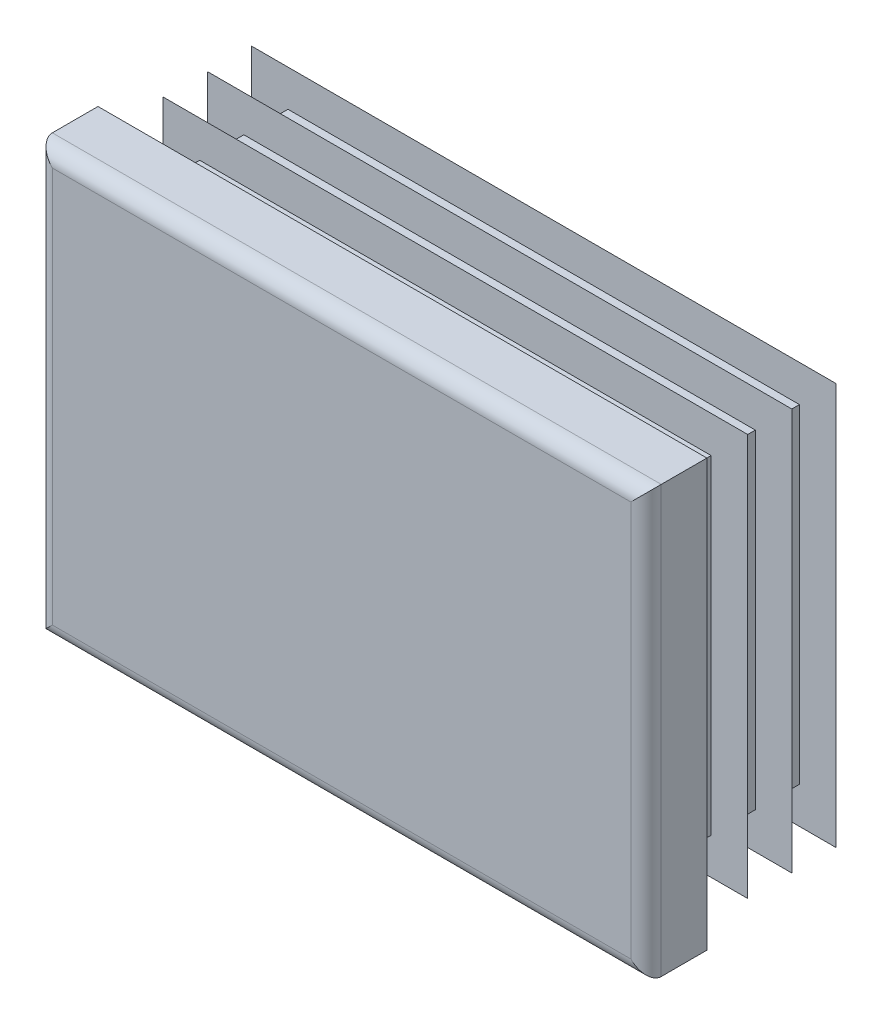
ISO-10303-21;
HEADER;
FILE_DESCRIPTION(('STEP AP214'),'2;1');
FILE_NAME('part.step','',(''),(''),'','','');
FILE_SCHEMA(('AUTOMOTIVE_DESIGN { 1 0 10303 214 1 1 1 1 }'));
ENDSEC;
DATA;
#1=APPLICATION_CONTEXT('core data for automotive mechanical design processes');
#2=APPLICATION_PROTOCOL_DEFINITION('international standard','automotive_design',2000,#1);
#3=PRODUCT_CONTEXT('',#1,'mechanical');
#4=PRODUCT('Part','Part','',(#3));
#5=PRODUCT_RELATED_PRODUCT_CATEGORY('part','',(#4));
#6=PRODUCT_DEFINITION_FORMATION('','',#4);
#7=PRODUCT_DEFINITION_CONTEXT('part definition',#1,'design');
#8=PRODUCT_DEFINITION('design','',#6,#7);
#9=PRODUCT_DEFINITION_SHAPE('','',#8);
#10=(LENGTH_UNIT() NAMED_UNIT(*) SI_UNIT(.MILLI.,.METRE.));
#11=(NAMED_UNIT(*) PLANE_ANGLE_UNIT() SI_UNIT($,.RADIAN.));
#12=(NAMED_UNIT(*) SI_UNIT($,.STERADIAN.) SOLID_ANGLE_UNIT());
#13=UNCERTAINTY_MEASURE_WITH_UNIT(LENGTH_MEASURE(1.E-05),#10,'distance_accuracy_value','');
#14=(GEOMETRIC_REPRESENTATION_CONTEXT(3) GLOBAL_UNCERTAINTY_ASSIGNED_CONTEXT((#13)) GLOBAL_UNIT_ASSIGNED_CONTEXT((#10,
#11,#12)) REPRESENTATION_CONTEXT('',''));
#15=CARTESIAN_POINT('',(0.,0.,0.));
#16=DIRECTION('',(0.,0.,1.));
#17=DIRECTION('',(1.,0.,0.));
#18=AXIS2_PLACEMENT_3D('',#15,#16,#17);
#19=CARTESIAN_POINT('',(23.75,-17.5,5.));
#20=DIRECTION('',(0.,0.,-1.));
#21=DIRECTION('',(0.,1.,0.));
#22=AXIS2_PLACEMENT_3D('',#19,#20,#21);
#23=PLANE('',#22);
#24=DIRECTION('',(0.,1.,0.));
#25=VECTOR('',#24,1.);
#26=CARTESIAN_POINT('',(-23.75,-17.5,5.));
#27=LINE('',#26,#25);
#28=CARTESIAN_POINT('',(-23.75,-16.25,5.));
#29=VERTEX_POINT('',#28);
#30=CARTESIAN_POINT('',(-23.75,16.25,5.));
#31=VERTEX_POINT('',#30);
#32=EDGE_CURVE('E310',#29,#31,#27,.T.);
#33=ORIENTED_EDGE('',*,*,#32,.F.);
#34=DIRECTION('',(-1.,0.,0.));
#35=VECTOR('',#34,1.);
#36=CARTESIAN_POINT('',(25.,-16.25,5.));
#37=LINE('',#36,#35);
#38=CARTESIAN_POINT('',(23.75,-16.25,5.));
#39=VERTEX_POINT('',#38);
#40=EDGE_CURVE('E482',#39,#29,#37,.T.);
#41=ORIENTED_EDGE('',*,*,#40,.F.);
#42=DIRECTION('',(0.,1.,0.));
#43=VECTOR('',#42,1.);
#44=CARTESIAN_POINT('',(23.75,-17.5,5.));
#45=LINE('',#44,#43);
#46=CARTESIAN_POINT('',(23.75,16.25,5.));
#47=VERTEX_POINT('',#46);
#48=EDGE_CURVE('E305',#39,#47,#45,.T.);
#49=ORIENTED_EDGE('',*,*,#48,.T.);
#50=DIRECTION('',(-1.,0.,0.));
#51=VECTOR('',#50,1.);
#52=CARTESIAN_POINT('',(25.,16.25,5.));
#53=LINE('',#52,#51);
#54=EDGE_CURVE('E630',#47,#31,#53,.T.);
#55=ORIENTED_EDGE('',*,*,#54,.T.);
#56=EDGE_LOOP('',(#33,#41,#49,#55));
#57=FACE_BOUND('',#56,.T.);
#58=ADVANCED_FACE('F14',(#57),#23,.F.);
#59=CARTESIAN_POINT('',(-23.75,-17.5,3.75));
#60=DIRECTION('',(0.,1.,0.));
#61=DIRECTION('',(-1.,0.,0.));
#62=AXIS2_PLACEMENT_3D('',#59,#60,#61);
#63=CYLINDRICAL_SURFACE('',#62,1.25);
#64=DIRECTION('',(0.,1.,0.));
#65=VECTOR('',#64,1.);
#66=CARTESIAN_POINT('',(-25.,-17.5,3.75));
#67=LINE('',#66,#65);
#68=CARTESIAN_POINT('',(-25.,-17.5,3.75));
#69=VERTEX_POINT('',#68);
#70=CARTESIAN_POINT('',(-25.,17.5,3.75));
#71=VERTEX_POINT('',#70);
#72=EDGE_CURVE('E402',#69,#71,#67,.T.);
#73=ORIENTED_EDGE('',*,*,#72,.F.);
#74=CARTESIAN_POINT('',(-23.75,-16.25,3.75));
#75=DIRECTION('',(-0.707106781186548,0.707106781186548,0.));
#76=DIRECTION('',(0.707106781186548,0.707106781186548,0.));
#77=AXIS2_PLACEMENT_3D('',#74,#75,#76);
#78=ELLIPSE('',#77,1.76776695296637,1.25);
#79=EDGE_CURVE('E59',#69,#29,#78,.T.);
#80=ORIENTED_EDGE('',*,*,#79,.T.);
#81=ORIENTED_EDGE('',*,*,#32,.T.);
#82=CARTESIAN_POINT('',(-23.75,16.25,3.75));
#83=DIRECTION('',(0.707106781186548,0.707106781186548,0.));
#84=DIRECTION('',(-0.707106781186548,0.707106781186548,0.));
#85=AXIS2_PLACEMENT_3D('',#82,#83,#84);
#86=ELLIPSE('',#85,1.76776695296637,1.25);
#87=EDGE_CURVE('E306',#31,#71,#86,.F.);
#88=ORIENTED_EDGE('',*,*,#87,.T.);
#89=EDGE_LOOP('',(#73,#80,#81,#88));
#90=FACE_BOUND('',#89,.T.);
#91=ADVANCED_FACE('F16',(#90),#63,.T.);
#92=CARTESIAN_POINT('',(-25.,-17.5,3.75));
#93=DIRECTION('',(1.,0.,0.));
#94=DIRECTION('',(0.,1.,0.));
#95=AXIS2_PLACEMENT_3D('',#92,#93,#94);
#96=PLANE('',#95);
#97=DIRECTION('',(0.,0.,-1.));
#98=VECTOR('',#97,1.);
#99=CARTESIAN_POINT('',(-25.,17.5,3.75));
#100=LINE('',#99,#98);
#101=CARTESIAN_POINT('',(-25.,17.5,0.));
#102=VERTEX_POINT('',#101);
#103=EDGE_CURVE('E615',#71,#102,#100,.T.);
#104=ORIENTED_EDGE('',*,*,#103,.T.);
#105=DIRECTION('',(0.,1.,0.));
#106=VECTOR('',#105,1.);
#107=CARTESIAN_POINT('',(-25.,-17.5,0.));
#108=LINE('',#107,#106);
#109=CARTESIAN_POINT('',(-25.,-17.5,0.));
#110=VERTEX_POINT('',#109);
#111=EDGE_CURVE('E400',#110,#102,#108,.T.);
#112=ORIENTED_EDGE('',*,*,#111,.F.);
#113=DIRECTION('',(0.,0.,-1.));
#114=VECTOR('',#113,1.);
#115=CARTESIAN_POINT('',(-25.,-17.5,3.75));
#116=LINE('',#115,#114);
#117=EDGE_CURVE('E616',#69,#110,#116,.T.);
#118=ORIENTED_EDGE('',*,*,#117,.F.);
#119=ORIENTED_EDGE('',*,*,#72,.T.);
#120=EDGE_LOOP('',(#104,#112,#118,#119));
#121=FACE_BOUND('',#120,.T.);
#122=ADVANCED_FACE('F697',(#121),#96,.F.);
#123=CARTESIAN_POINT('',(-21.,-17.5,0.));
#124=DIRECTION('',(1.,0.,0.));
#125=DIRECTION('',(0.,1.,0.));
#126=AXIS2_PLACEMENT_3D('',#123,#124,#125);
#127=PLANE('',#126);
#128=DIRECTION('',(0.,1.,0.));
#129=VECTOR('',#128,1.);
#130=CARTESIAN_POINT('',(-21.,-17.5,0.));
#131=LINE('',#130,#129);
#132=CARTESIAN_POINT('',(-21.,-13.5,0.));
#133=VERTEX_POINT('',#132);
#134=CARTESIAN_POINT('',(-21.,13.5,0.));
#135=VERTEX_POINT('',#134);
#136=EDGE_CURVE('E397',#133,#135,#131,.T.);
#137=ORIENTED_EDGE('',*,*,#136,.T.);
#138=DIRECTION('',(0.,0.,-1.));
#139=VECTOR('',#138,1.);
#140=CARTESIAN_POINT('',(-21.,13.5,0.));
#141=LINE('',#140,#139);
#142=CARTESIAN_POINT('',(-21.,13.5,-0.725));
#143=VERTEX_POINT('',#142);
#144=EDGE_CURVE('E495',#135,#143,#141,.T.);
#145=ORIENTED_EDGE('',*,*,#144,.T.);
#146=DIRECTION('',(0.,1.,0.));
#147=VECTOR('',#146,1.);
#148=CARTESIAN_POINT('',(-21.,-17.5,-0.725));
#149=LINE('',#148,#147);
#150=CARTESIAN_POINT('',(-21.,-13.5,-0.725));
#151=VERTEX_POINT('',#150);
#152=EDGE_CURVE('E394',#151,#143,#149,.T.);
#153=ORIENTED_EDGE('',*,*,#152,.F.);
#154=DIRECTION('',(0.,0.,1.));
#155=VECTOR('',#154,1.);
#156=CARTESIAN_POINT('',(-21.,-13.5,0.));
#157=LINE('',#156,#155);
#158=EDGE_CURVE('E489',#151,#133,#157,.T.);
#159=ORIENTED_EDGE('',*,*,#158,.T.);
#160=EDGE_LOOP('',(#137,#145,#153,#159));
#161=FACE_BOUND('',#160,.T.);
#162=ADVANCED_FACE('F787',(#161),#127,.F.);
#163=CARTESIAN_POINT('',(-24.,-17.5,-0.725));
#164=DIRECTION('',(0.342020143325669,0.,0.939692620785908));
#165=DIRECTION('',(-0.939692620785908,0.,0.342020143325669));
#166=AXIS2_PLACEMENT_3D('',#163,#164,#165);
#167=PLANE('',#166);
#168=DIRECTION('',(0.,1.,0.));
#169=VECTOR('',#168,1.);
#170=CARTESIAN_POINT('',(-24.,-17.5,-0.725));
#171=LINE('',#170,#169);
#172=CARTESIAN_POINT('',(-24.,-16.5,-0.725));
#173=VERTEX_POINT('',#172);
#174=CARTESIAN_POINT('',(-24.,16.5,-0.725));
#175=VERTEX_POINT('',#174);
#176=EDGE_CURVE('E392',#173,#175,#171,.T.);
#177=ORIENTED_EDGE('',*,*,#176,.T.);
#178=DIRECTION('',(0.844349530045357,-0.438895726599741,-0.307318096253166));
#179=VECTOR('',#178,1.);
#180=CARTESIAN_POINT('',(-11.4002323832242,9.9505983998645,-5.31094037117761));
#181=LINE('',#180,#179);
#182=CARTESIAN_POINT('',(-21.,14.9405899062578,-1.81691070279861));
#183=VERTEX_POINT('',#182);
#184=EDGE_CURVE('E519',#175,#183,#181,.T.);
#185=ORIENTED_EDGE('',*,*,#184,.T.);
#186=DIRECTION('',(0.,1.,0.));
#187=VECTOR('',#186,1.);
#188=CARTESIAN_POINT('',(-21.,-17.5,-1.81691070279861));
#189=LINE('',#188,#187);
#190=CARTESIAN_POINT('',(-21.,-14.9405899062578,-1.81691070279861));
#191=VERTEX_POINT('',#190);
#192=EDGE_CURVE('E389',#191,#183,#189,.T.);
#193=ORIENTED_EDGE('',*,*,#192,.F.);
#194=DIRECTION('',(-0.844349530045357,-0.43889572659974,0.307318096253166));
#195=VECTOR('',#194,1.);
#196=CARTESIAN_POINT('',(-24.3705814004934,-16.6926294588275,-0.590119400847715));
#197=LINE('',#196,#195);
#198=EDGE_CURVE('E507',#191,#173,#197,.T.);
#199=ORIENTED_EDGE('',*,*,#198,.T.);
#200=EDGE_LOOP('',(#177,#185,#193,#199));
#201=FACE_BOUND('',#200,.T.);
#202=ADVANCED_FACE('F783',(#201),#167,.F.);
#203=CARTESIAN_POINT('',(-21.,-17.5,-1.81691070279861));
#204=DIRECTION('',(1.,0.,0.));
#205=DIRECTION('',(0.,1.,0.));
#206=AXIS2_PLACEMENT_3D('',#203,#204,#205);
#207=PLANE('',#206);
#208=ORIENTED_EDGE('',*,*,#192,.T.);
#209=DIRECTION('',(0.,-0.819152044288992,-0.573576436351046));
#210=VECTOR('',#209,1.);
#211=CARTESIAN_POINT('',(-21.,-6.82737265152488,-17.0590021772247));
#212=LINE('',#211,#210);
#213=CARTESIAN_POINT('',(-21.,13.5,-2.82562261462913));
#214=VERTEX_POINT('',#213);
#215=EDGE_CURVE('E516',#183,#214,#212,.T.);
#216=ORIENTED_EDGE('',*,*,#215,.T.);
#217=DIRECTION('',(0.,0.,-1.));
#218=VECTOR('',#217,1.);
#219=CARTESIAN_POINT('',(-21.,13.5,-1.81691070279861));
#220=LINE('',#219,#218);
#221=CARTESIAN_POINT('',(-21.,13.5,-4.35));
#222=VERTEX_POINT('',#221);
#223=EDGE_CURVE('E525',#214,#222,#220,.T.);
#224=ORIENTED_EDGE('',*,*,#223,.T.);
#225=DIRECTION('',(0.,1.,0.));
#226=VECTOR('',#225,1.);
#227=CARTESIAN_POINT('',(-21.,-17.5,-4.35));
#228=LINE('',#227,#226);
#229=CARTESIAN_POINT('',(-21.,-13.5,-4.35));
#230=VERTEX_POINT('',#229);
#231=EDGE_CURVE('E386',#230,#222,#228,.T.);
#232=ORIENTED_EDGE('',*,*,#231,.F.);
#233=DIRECTION('',(0.,0.,1.));
#234=VECTOR('',#233,1.);
#235=CARTESIAN_POINT('',(-21.,-13.5,-1.81691070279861));
#236=LINE('',#235,#234);
#237=CARTESIAN_POINT('',(-21.,-13.5,-2.82562261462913));
#238=VERTEX_POINT('',#237);
#239=EDGE_CURVE('E522',#230,#238,#236,.T.);
#240=ORIENTED_EDGE('',*,*,#239,.T.);
#241=DIRECTION('',(0.,-0.819152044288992,0.573576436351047));
#242=VECTOR('',#241,1.);
#243=CARTESIAN_POINT('',(-21.,-16.6579798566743,-0.614381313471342));
#244=LINE('',#243,#242);
#245=EDGE_CURVE('E504',#238,#191,#244,.T.);
#246=ORIENTED_EDGE('',*,*,#245,.T.);
#247=EDGE_LOOP('',(#208,#216,#224,#232,#240,#246));
#248=FACE_BOUND('',#247,.T.);
#249=ADVANCED_FACE('F779',(#248),#207,.F.);
#250=CARTESIAN_POINT('',(-24.,-17.5,-4.35));
#251=DIRECTION('',(0.342020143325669,0.,0.939692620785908));
#252=DIRECTION('',(-0.939692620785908,0.,0.342020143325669));
#253=AXIS2_PLACEMENT_3D('',#250,#251,#252);
#254=PLANE('',#253);
#255=DIRECTION('',(0.,1.,0.));
#256=VECTOR('',#255,1.);
#257=CARTESIAN_POINT('',(-24.,-17.5,-4.35));
#258=LINE('',#257,#256);
#259=CARTESIAN_POINT('',(-24.,-16.5,-4.35));
#260=VERTEX_POINT('',#259);
#261=CARTESIAN_POINT('',(-24.,16.5,-4.35));
#262=VERTEX_POINT('',#261);
#263=EDGE_CURVE('E384',#260,#262,#258,.T.);
#264=ORIENTED_EDGE('',*,*,#263,.T.);
#265=DIRECTION('',(0.844349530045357,-0.438895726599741,-0.307318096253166));
#266=VECTOR('',#265,1.);
#267=CARTESIAN_POINT('',(-11.4002323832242,9.9505983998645,-8.93594037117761));
#268=LINE('',#267,#266);
#269=CARTESIAN_POINT('',(-21.,14.9405899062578,-5.44191070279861));
#270=VERTEX_POINT('',#269);
#271=EDGE_CURVE('E549',#262,#270,#268,.T.);
#272=ORIENTED_EDGE('',*,*,#271,.T.);
#273=DIRECTION('',(0.,1.,0.));
#274=VECTOR('',#273,1.);
#275=CARTESIAN_POINT('',(-21.,-17.5,-5.44191070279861));
#276=LINE('',#275,#274);
#277=CARTESIAN_POINT('',(-21.,-14.9405899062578,-5.44191070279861));
#278=VERTEX_POINT('',#277);
#279=EDGE_CURVE('E381',#278,#270,#276,.T.);
#280=ORIENTED_EDGE('',*,*,#279,.F.);
#281=DIRECTION('',(-0.844349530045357,-0.438895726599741,0.307318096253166));
#282=VECTOR('',#281,1.);
#283=CARTESIAN_POINT('',(-24.3705814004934,-16.6926294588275,-4.21511940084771));
#284=LINE('',#283,#282);
#285=EDGE_CURVE('E537',#278,#260,#284,.T.);
#286=ORIENTED_EDGE('',*,*,#285,.T.);
#287=EDGE_LOOP('',(#264,#272,#280,#286));
#288=FACE_BOUND('',#287,.T.);
#289=ADVANCED_FACE('F775',(#288),#254,.F.);
#290=CARTESIAN_POINT('',(-21.,-17.5,-5.44191070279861));
#291=DIRECTION('',(1.,0.,0.));
#292=DIRECTION('',(0.,1.,0.));
#293=AXIS2_PLACEMENT_3D('',#290,#291,#292);
#294=PLANE('',#293);
#295=ORIENTED_EDGE('',*,*,#279,.T.);
#296=DIRECTION('',(0.,-0.819152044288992,-0.573576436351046));
#297=VECTOR('',#296,1.);
#298=CARTESIAN_POINT('',(-21.,-6.82737265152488,-20.6840021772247));
#299=LINE('',#298,#297);
#300=CARTESIAN_POINT('',(-21.,13.5,-6.45062261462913));
#301=VERTEX_POINT('',#300);
#302=EDGE_CURVE('E546',#270,#301,#299,.T.);
#303=ORIENTED_EDGE('',*,*,#302,.T.);
#304=DIRECTION('',(0.,0.,-1.));
#305=VECTOR('',#304,1.);
#306=CARTESIAN_POINT('',(-21.,13.5,-5.44191070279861));
#307=LINE('',#306,#305);
#308=CARTESIAN_POINT('',(-21.,13.5,-7.975));
#309=VERTEX_POINT('',#308);
#310=EDGE_CURVE('E555',#301,#309,#307,.T.);
#311=ORIENTED_EDGE('',*,*,#310,.T.);
#312=DIRECTION('',(0.,1.,0.));
#313=VECTOR('',#312,1.);
#314=CARTESIAN_POINT('',(-21.,-17.5,-7.975));
#315=LINE('',#314,#313);
#316=CARTESIAN_POINT('',(-21.,-13.5,-7.975));
#317=VERTEX_POINT('',#316);
#318=EDGE_CURVE('E378',#317,#309,#315,.T.);
#319=ORIENTED_EDGE('',*,*,#318,.F.);
#320=DIRECTION('',(0.,0.,1.));
#321=VECTOR('',#320,1.);
#322=CARTESIAN_POINT('',(-21.,-13.5,-5.44191070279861));
#323=LINE('',#322,#321);
#324=CARTESIAN_POINT('',(-21.,-13.5,-6.45062261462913));
#325=VERTEX_POINT('',#324);
#326=EDGE_CURVE('E552',#317,#325,#323,.T.);
#327=ORIENTED_EDGE('',*,*,#326,.T.);
#328=DIRECTION('',(0.,-0.819152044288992,0.573576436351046));
#329=VECTOR('',#328,1.);
#330=CARTESIAN_POINT('',(-21.,-16.6579798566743,-4.23938131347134));
#331=LINE('',#330,#329);
#332=EDGE_CURVE('E534',#325,#278,#331,.T.);
#333=ORIENTED_EDGE('',*,*,#332,.T.);
#334=EDGE_LOOP('',(#295,#303,#311,#319,#327,#333));
#335=FACE_BOUND('',#334,.T.);
#336=ADVANCED_FACE('F771',(#335),#294,.F.);
#337=CARTESIAN_POINT('',(-24.,-17.5,-7.975));
#338=DIRECTION('',(0.342020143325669,0.,0.939692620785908));
#339=DIRECTION('',(-0.939692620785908,0.,0.342020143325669));
#340=AXIS2_PLACEMENT_3D('',#337,#338,#339);
#341=PLANE('',#340);
#342=DIRECTION('',(0.,1.,0.));
#343=VECTOR('',#342,1.);
#344=CARTESIAN_POINT('',(-24.,-17.5,-7.975));
#345=LINE('',#344,#343);
#346=CARTESIAN_POINT('',(-24.,-16.5,-7.975));
#347=VERTEX_POINT('',#346);
#348=CARTESIAN_POINT('',(-24.,16.5,-7.975));
#349=VERTEX_POINT('',#348);
#350=EDGE_CURVE('E376',#347,#349,#345,.T.);
#351=ORIENTED_EDGE('',*,*,#350,.T.);
#352=DIRECTION('',(0.844349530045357,-0.438895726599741,-0.307318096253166));
#353=VECTOR('',#352,1.);
#354=CARTESIAN_POINT('',(-11.4002323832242,9.95059839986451,-12.5609403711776));
#355=LINE('',#354,#353);
#356=CARTESIAN_POINT('',(-21.,14.9405899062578,-9.06691070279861));
#357=VERTEX_POINT('',#356);
#358=EDGE_CURVE('E579',#349,#357,#355,.T.);
#359=ORIENTED_EDGE('',*,*,#358,.T.);
#360=DIRECTION('',(0.,1.,0.));
#361=VECTOR('',#360,1.);
#362=CARTESIAN_POINT('',(-21.,-17.5,-9.06691070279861));
#363=LINE('',#362,#361);
#364=CARTESIAN_POINT('',(-21.,-14.9405899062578,-9.06691070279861));
#365=VERTEX_POINT('',#364);
#366=EDGE_CURVE('E373',#365,#357,#363,.T.);
#367=ORIENTED_EDGE('',*,*,#366,.F.);
#368=DIRECTION('',(-0.844349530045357,-0.438895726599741,0.307318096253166));
#369=VECTOR('',#368,1.);
#370=CARTESIAN_POINT('',(-24.3705814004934,-16.6926294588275,-7.84011940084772));
#371=LINE('',#370,#369);
#372=EDGE_CURVE('E567',#365,#347,#371,.T.);
#373=ORIENTED_EDGE('',*,*,#372,.T.);
#374=EDGE_LOOP('',(#351,#359,#367,#373));
#375=FACE_BOUND('',#374,.T.);
#376=ADVANCED_FACE('F767',(#375),#341,.F.);
#377=CARTESIAN_POINT('',(-21.,-17.5,-9.06691070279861));
#378=DIRECTION('',(1.,0.,0.));
#379=DIRECTION('',(0.,1.,0.));
#380=AXIS2_PLACEMENT_3D('',#377,#378,#379);
#381=PLANE('',#380);
#382=ORIENTED_EDGE('',*,*,#366,.T.);
#383=DIRECTION('',(0.,-0.819152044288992,-0.573576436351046));
#384=VECTOR('',#383,1.);
#385=CARTESIAN_POINT('',(-21.,-6.82737265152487,-24.3090021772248));
#386=LINE('',#385,#384);
#387=CARTESIAN_POINT('',(-21.,13.5,-10.0756226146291));
#388=VERTEX_POINT('',#387);
#389=EDGE_CURVE('E576',#357,#388,#386,.T.);
#390=ORIENTED_EDGE('',*,*,#389,.T.);
#391=DIRECTION('',(0.,0.,-1.));
#392=VECTOR('',#391,1.);
#393=CARTESIAN_POINT('',(-21.,13.5,-9.06691070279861));
#394=LINE('',#393,#392);
#395=CARTESIAN_POINT('',(-21.,13.5,-11.6));
#396=VERTEX_POINT('',#395);
#397=EDGE_CURVE('E585',#388,#396,#394,.T.);
#398=ORIENTED_EDGE('',*,*,#397,.T.);
#399=DIRECTION('',(0.,1.,0.));
#400=VECTOR('',#399,1.);
#401=CARTESIAN_POINT('',(-21.,-17.5,-11.6));
#402=LINE('',#401,#400);
#403=CARTESIAN_POINT('',(-21.,-13.5,-11.6));
#404=VERTEX_POINT('',#403);
#405=EDGE_CURVE('E370',#404,#396,#402,.T.);
#406=ORIENTED_EDGE('',*,*,#405,.F.);
#407=DIRECTION('',(0.,0.,1.));
#408=VECTOR('',#407,1.);
#409=CARTESIAN_POINT('',(-21.,-13.5,-9.06691070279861));
#410=LINE('',#409,#408);
#411=CARTESIAN_POINT('',(-21.,-13.5,-10.0756226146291));
#412=VERTEX_POINT('',#411);
#413=EDGE_CURVE('E582',#404,#412,#410,.T.);
#414=ORIENTED_EDGE('',*,*,#413,.T.);
#415=DIRECTION('',(0.,-0.819152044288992,0.573576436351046));
#416=VECTOR('',#415,1.);
#417=CARTESIAN_POINT('',(-21.,-16.6579798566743,-7.86438131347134));
#418=LINE('',#417,#416);
#419=EDGE_CURVE('E564',#412,#365,#418,.T.);
#420=ORIENTED_EDGE('',*,*,#419,.T.);
#421=EDGE_LOOP('',(#382,#390,#398,#406,#414,#420));
#422=FACE_BOUND('',#421,.T.);
#423=ADVANCED_FACE('F764',(#422),#381,.F.);
#424=CARTESIAN_POINT('',(-24.,-17.5,-11.6));
#425=DIRECTION('',(0.342020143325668,0.,0.939692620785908));
#426=DIRECTION('',(-0.939692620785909,0.,0.342020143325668));
#427=AXIS2_PLACEMENT_3D('',#424,#425,#426);
#428=PLANE('',#427);
#429=DIRECTION('',(0.,1.,0.));
#430=VECTOR('',#429,1.);
#431=CARTESIAN_POINT('',(-24.,-17.5,-11.6));
#432=LINE('',#431,#430);
#433=CARTESIAN_POINT('',(-24.,-16.5,-11.6));
#434=VERTEX_POINT('',#433);
#435=CARTESIAN_POINT('',(-24.,16.5,-11.6));
#436=VERTEX_POINT('',#435);
#437=EDGE_CURVE('E368',#434,#436,#432,.T.);
#438=ORIENTED_EDGE('',*,*,#437,.T.);
#439=DIRECTION('',(0.844349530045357,-0.43889572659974,-0.307318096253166));
#440=VECTOR('',#439,1.);
#441=CARTESIAN_POINT('',(-11.4002323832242,9.95059839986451,-16.1859403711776));
#442=LINE('',#441,#440);
#443=CARTESIAN_POINT('',(-21.,14.9405899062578,-12.6919107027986));
#444=VERTEX_POINT('',#443);
#445=EDGE_CURVE('E607',#436,#444,#442,.T.);
#446=ORIENTED_EDGE('',*,*,#445,.T.);
#447=DIRECTION('',(0.,1.,0.));
#448=VECTOR('',#447,1.);
#449=CARTESIAN_POINT('',(-21.,-17.5,-12.6919107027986));
#450=LINE('',#449,#448);
#451=CARTESIAN_POINT('',(-21.,-14.9405899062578,-12.6919107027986));
#452=VERTEX_POINT('',#451);
#453=EDGE_CURVE('E365',#452,#444,#450,.T.);
#454=ORIENTED_EDGE('',*,*,#453,.F.);
#455=DIRECTION('',(-0.844349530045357,-0.438895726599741,0.307318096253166));
#456=VECTOR('',#455,1.);
#457=CARTESIAN_POINT('',(-24.3705814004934,-16.6926294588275,-11.4651194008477));
#458=LINE('',#457,#456);
#459=EDGE_CURVE('E595',#452,#434,#458,.T.);
#460=ORIENTED_EDGE('',*,*,#459,.T.);
#461=EDGE_LOOP('',(#438,#446,#454,#460));
#462=FACE_BOUND('',#461,.T.);
#463=ADVANCED_FACE('F675',(#462),#428,.F.);
#464=CARTESIAN_POINT('',(-21.,-17.5,-12.6919107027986));
#465=DIRECTION('',(1.,0.,0.));
#466=DIRECTION('',(0.,1.,0.));
#467=AXIS2_PLACEMENT_3D('',#464,#465,#466);
#468=PLANE('',#467);
#469=ORIENTED_EDGE('',*,*,#453,.T.);
#470=DIRECTION('',(0.,-0.819152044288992,-0.573576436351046));
#471=VECTOR('',#470,1.);
#472=CARTESIAN_POINT('',(-21.,-6.82737265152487,-27.9340021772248));
#473=LINE('',#472,#471);
#474=CARTESIAN_POINT('',(-21.,13.5,-13.7006226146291));
#475=VERTEX_POINT('',#474);
#476=EDGE_CURVE('E604',#444,#475,#473,.T.);
#477=ORIENTED_EDGE('',*,*,#476,.T.);
#478=DIRECTION('',(0.,0.,-1.));
#479=VECTOR('',#478,1.);
#480=CARTESIAN_POINT('',(-21.,13.5,-12.6919107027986));
#481=LINE('',#480,#479);
#482=CARTESIAN_POINT('',(-21.,13.5,-14.5));
#483=VERTEX_POINT('',#482);
#484=EDGE_CURVE('E613',#475,#483,#481,.T.);
#485=ORIENTED_EDGE('',*,*,#484,.T.);
#486=DIRECTION('',(0.,1.,0.));
#487=VECTOR('',#486,1.);
#488=CARTESIAN_POINT('',(-21.,-17.5,-14.5));
#489=LINE('',#488,#487);
#490=CARTESIAN_POINT('',(-21.,-13.5,-14.5));
#491=VERTEX_POINT('',#490);
#492=EDGE_CURVE('E362',#491,#483,#489,.T.);
#493=ORIENTED_EDGE('',*,*,#492,.F.);
#494=DIRECTION('',(0.,0.,1.));
#495=VECTOR('',#494,1.);
#496=CARTESIAN_POINT('',(-21.,-13.5,-12.6919107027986));
#497=LINE('',#496,#495);
#498=CARTESIAN_POINT('',(-21.,-13.5,-13.7006226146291));
#499=VERTEX_POINT('',#498);
#500=EDGE_CURVE('E610',#491,#499,#497,.T.);
#501=ORIENTED_EDGE('',*,*,#500,.T.);
#502=DIRECTION('',(0.,-0.819152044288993,0.573576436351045));
#503=VECTOR('',#502,1.);
#504=CARTESIAN_POINT('',(-21.,-16.6579798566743,-11.4893813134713));
#505=LINE('',#504,#503);
#506=EDGE_CURVE('E592',#499,#452,#505,.T.);
#507=ORIENTED_EDGE('',*,*,#506,.T.);
#508=EDGE_LOOP('',(#469,#477,#485,#493,#501,#507));
#509=FACE_BOUND('',#508,.T.);
#510=ADVANCED_FACE('F677',(#509),#468,.F.);
#511=CARTESIAN_POINT('',(-21.,-17.5,-14.5));
#512=DIRECTION('',(0.,0.,1.));
#513=DIRECTION('',(0.,-1.,0.));
#514=AXIS2_PLACEMENT_3D('',#511,#512,#513);
#515=PLANE('',#514);
#516=ORIENTED_EDGE('',*,*,#492,.T.);
#517=DIRECTION('',(-1.,0.,0.));
#518=VECTOR('',#517,1.);
#519=CARTESIAN_POINT('',(25.,13.5,-14.5));
#520=LINE('',#519,#518);
#521=CARTESIAN_POINT('',(21.,13.5,-14.5));
#522=VERTEX_POINT('',#521);
#523=EDGE_CURVE('E438',#522,#483,#520,.T.);
#524=ORIENTED_EDGE('',*,*,#523,.F.);
#525=DIRECTION('',(0.,1.,0.));
#526=VECTOR('',#525,1.);
#527=CARTESIAN_POINT('',(21.,-17.5,-14.5));
#528=LINE('',#527,#526);
#529=CARTESIAN_POINT('',(21.,-13.5,-14.5));
#530=VERTEX_POINT('',#529);
#531=EDGE_CURVE('E359',#530,#522,#528,.T.);
#532=ORIENTED_EDGE('',*,*,#531,.F.);
#533=DIRECTION('',(-1.,0.,0.));
#534=VECTOR('',#533,1.);
#535=CARTESIAN_POINT('',(25.,-13.5,-14.5));
#536=LINE('',#535,#534);
#537=EDGE_CURVE('E436',#530,#491,#536,.T.);
#538=ORIENTED_EDGE('',*,*,#537,.T.);
#539=EDGE_LOOP('',(#516,#524,#532,#538));
#540=FACE_BOUND('',#539,.T.);
#541=ADVANCED_FACE('F435',(#540),#515,.F.);
#542=CARTESIAN_POINT('',(21.,-17.5,-14.5));
#543=DIRECTION('',(-1.,0.,0.));
#544=DIRECTION('',(0.,-1.,0.));
#545=AXIS2_PLACEMENT_3D('',#542,#543,#544);
#546=PLANE('',#545);
#547=DIRECTION('',(0.,0.,1.));
#548=VECTOR('',#547,1.);
#549=CARTESIAN_POINT('',(21.,13.5,-14.5));
#550=LINE('',#549,#548);
#551=CARTESIAN_POINT('',(21.,13.5,-13.7006226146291));
#552=VERTEX_POINT('',#551);
#553=EDGE_CURVE('E9',#522,#552,#550,.T.);
#554=ORIENTED_EDGE('',*,*,#553,.T.);
#555=DIRECTION('',(0.,0.819152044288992,0.573576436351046));
#556=VECTOR('',#555,1.);
#557=CARTESIAN_POINT('',(21.,-7.67689673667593,-28.5288453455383));
#558=LINE('',#557,#556);
#559=CARTESIAN_POINT('',(21.,14.9405899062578,-12.6919107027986));
#560=VERTEX_POINT('',#559);
#561=EDGE_CURVE('E601',#552,#560,#558,.T.);
#562=ORIENTED_EDGE('',*,*,#561,.T.);
#563=DIRECTION('',(0.,1.,0.));
#564=VECTOR('',#563,1.);
#565=CARTESIAN_POINT('',(21.,-17.5,-12.6919107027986));
#566=LINE('',#565,#564);
#567=CARTESIAN_POINT('',(21.,-14.9405899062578,-12.6919107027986));
#568=VERTEX_POINT('',#567);
#569=EDGE_CURVE('E356',#568,#560,#566,.T.);
#570=ORIENTED_EDGE('',*,*,#569,.F.);
#571=DIRECTION('',(0.,0.819152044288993,-0.573576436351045));
#572=VECTOR('',#571,1.);
#573=CARTESIAN_POINT('',(21.,-15.8084557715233,-12.0842244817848));
#574=LINE('',#573,#572);
#575=CARTESIAN_POINT('',(21.,-13.5,-13.7006226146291));
#576=VERTEX_POINT('',#575);
#577=EDGE_CURVE('E428',#568,#576,#574,.T.);
#578=ORIENTED_EDGE('',*,*,#577,.T.);
#579=DIRECTION('',(0.,0.,-1.));
#580=VECTOR('',#579,1.);
#581=CARTESIAN_POINT('',(21.,-13.5,-14.5));
#582=LINE('',#581,#580);
#583=EDGE_CURVE('E23',#576,#530,#582,.T.);
#584=ORIENTED_EDGE('',*,*,#583,.T.);
#585=ORIENTED_EDGE('',*,*,#531,.T.);
#586=EDGE_LOOP('',(#554,#562,#570,#578,#584,#585));
#587=FACE_BOUND('',#586,.T.);
#588=ADVANCED_FACE('F426',(#587),#546,.F.);
#589=CARTESIAN_POINT('',(21.,-17.5,-12.6919107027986));
#590=DIRECTION('',(-0.342020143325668,0.,0.939692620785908));
#591=DIRECTION('',(-0.939692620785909,0.,-0.342020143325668));
#592=AXIS2_PLACEMENT_3D('',#589,#590,#591);
#593=PLANE('',#592);
#594=ORIENTED_EDGE('',*,*,#569,.T.);
#595=DIRECTION('',(0.844349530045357,0.43889572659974,0.307318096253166));
#596=VECTOR('',#595,1.);
#597=CARTESIAN_POINT('',(8.97812075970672,8.69157662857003,-17.0675169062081));
#598=LINE('',#597,#596);
#599=CARTESIAN_POINT('',(24.,16.5,-11.6));
#600=VERTEX_POINT('',#599);
#601=EDGE_CURVE('E598',#560,#600,#598,.T.);
#602=ORIENTED_EDGE('',*,*,#601,.T.);
#603=DIRECTION('',(0.,1.,0.));
#604=VECTOR('',#603,1.);
#605=CARTESIAN_POINT('',(24.,-17.5,-11.6));
#606=LINE('',#605,#604);
#607=CARTESIAN_POINT('',(24.,-16.5,-11.6));
#608=VERTEX_POINT('',#607);
#609=EDGE_CURVE('E353',#608,#600,#606,.T.);
#610=ORIENTED_EDGE('',*,*,#609,.F.);
#611=DIRECTION('',(-0.844349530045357,0.438895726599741,-0.307318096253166));
#612=VECTOR('',#611,1.);
#613=CARTESIAN_POINT('',(21.948469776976,-15.433607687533,-12.3466959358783));
#614=LINE('',#613,#612);
#615=EDGE_CURVE('E588',#608,#568,#614,.T.);
#616=ORIENTED_EDGE('',*,*,#615,.T.);
#617=EDGE_LOOP('',(#594,#602,#610,#616));
#618=FACE_BOUND('',#617,.T.);
#619=ADVANCED_FACE('F752',(#618),#593,.F.);
#620=CARTESIAN_POINT('',(24.,-17.5,-11.6));
#621=DIRECTION('',(0.,0.,-1.));
#622=DIRECTION('',(0.,1.,0.));
#623=AXIS2_PLACEMENT_3D('',#620,#621,#622);
#624=PLANE('',#623);
#625=ORIENTED_EDGE('',*,*,#609,.T.);
#626=DIRECTION('',(-1.,0.,0.));
#627=VECTOR('',#626,1.);
#628=CARTESIAN_POINT('',(25.,16.5,-11.6));
#629=LINE('',#628,#627);
#630=EDGE_CURVE('E444',#600,#436,#629,.T.);
#631=ORIENTED_EDGE('',*,*,#630,.T.);
#632=ORIENTED_EDGE('',*,*,#437,.F.);
#633=DIRECTION('',(-1.,0.,0.));
#634=VECTOR('',#633,1.);
#635=CARTESIAN_POINT('',(25.,-16.5,-11.6));
#636=LINE('',#635,#634);
#637=EDGE_CURVE('E451',#608,#434,#636,.T.);
#638=ORIENTED_EDGE('',*,*,#637,.F.);
#639=EDGE_LOOP('',(#625,#631,#632,#638));
#640=FACE_BOUND('',#639,.T.);
#641=ORIENTED_EDGE('',*,*,#405,.T.);
#642=DIRECTION('',(-1.,0.,0.));
#643=VECTOR('',#642,1.);
#644=CARTESIAN_POINT('',(25.,13.5,-11.6));
#645=LINE('',#644,#643);
#646=CARTESIAN_POINT('',(21.,13.5,-11.6));
#647=VERTEX_POINT('',#646);
#648=EDGE_CURVE('E663',#647,#396,#645,.T.);
#649=ORIENTED_EDGE('',*,*,#648,.F.);
#650=DIRECTION('',(0.,1.,0.));
#651=VECTOR('',#650,1.);
#652=CARTESIAN_POINT('',(21.,-17.5,-11.6));
#653=LINE('',#652,#651);
#654=CARTESIAN_POINT('',(21.,-13.5,-11.6));
#655=VERTEX_POINT('',#654);
#656=EDGE_CURVE('E350',#655,#647,#653,.T.);
#657=ORIENTED_EDGE('',*,*,#656,.F.);
#658=DIRECTION('',(-1.,0.,0.));
#659=VECTOR('',#658,1.);
#660=CARTESIAN_POINT('',(25.,-13.5,-11.6));
#661=LINE('',#660,#659);
#662=EDGE_CURVE('E453',#655,#404,#661,.T.);
#663=ORIENTED_EDGE('',*,*,#662,.T.);
#664=EDGE_LOOP('',(#641,#649,#657,#663));
#665=FACE_BOUND('',#664,.T.);
#666=ADVANCED_FACE('F667',(#640,#665),#624,.F.);
#667=CARTESIAN_POINT('',(21.,-17.5,-11.6));
#668=DIRECTION('',(-1.,0.,0.));
#669=DIRECTION('',(0.,-1.,0.));
#670=AXIS2_PLACEMENT_3D('',#667,#668,#669);
#671=PLANE('',#670);
#672=DIRECTION('',(0.,0.,1.));
#673=VECTOR('',#672,1.);
#674=CARTESIAN_POINT('',(21.,13.5,-11.6));
#675=LINE('',#674,#673);
#676=CARTESIAN_POINT('',(21.,13.5,-10.0756226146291));
#677=VERTEX_POINT('',#676);
#678=EDGE_CURVE('E420',#647,#677,#675,.T.);
#679=ORIENTED_EDGE('',*,*,#678,.T.);
#680=DIRECTION('',(0.,0.819152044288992,0.573576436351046));
#681=VECTOR('',#680,1.);
#682=CARTESIAN_POINT('',(21.,-8.01753531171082,-25.1423630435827));
#683=LINE('',#682,#681);
#684=CARTESIAN_POINT('',(21.,14.9405899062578,-9.06691070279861));
#685=VERTEX_POINT('',#684);
#686=EDGE_CURVE('E573',#677,#685,#683,.T.);
#687=ORIENTED_EDGE('',*,*,#686,.T.);
#688=DIRECTION('',(0.,1.,0.));
#689=VECTOR('',#688,1.);
#690=CARTESIAN_POINT('',(21.,-17.5,-9.06691070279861));
#691=LINE('',#690,#689);
#692=CARTESIAN_POINT('',(21.,-14.9405899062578,-9.06691070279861));
#693=VERTEX_POINT('',#692);
#694=EDGE_CURVE('E347',#693,#685,#691,.T.);
#695=ORIENTED_EDGE('',*,*,#694,.F.);
#696=DIRECTION('',(0.,0.819152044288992,-0.573576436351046));
#697=VECTOR('',#696,1.);
#698=CARTESIAN_POINT('',(21.,-15.4678171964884,-8.69774217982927));
#699=LINE('',#698,#697);
#700=CARTESIAN_POINT('',(21.,-13.5,-10.0756226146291));
#701=VERTEX_POINT('',#700);
#702=EDGE_CURVE('E561',#693,#701,#699,.T.);
#703=ORIENTED_EDGE('',*,*,#702,.T.);
#704=DIRECTION('',(0.,0.,-1.));
#705=VECTOR('',#704,1.);
#706=CARTESIAN_POINT('',(21.,-13.5,-11.6));
#707=LINE('',#706,#705);
#708=EDGE_CURVE('E417',#701,#655,#707,.T.);
#709=ORIENTED_EDGE('',*,*,#708,.T.);
#710=ORIENTED_EDGE('',*,*,#656,.T.);
#711=EDGE_LOOP('',(#679,#687,#695,#703,#709,#710));
#712=FACE_BOUND('',#711,.T.);
#713=ADVANCED_FACE('F745',(#712),#671,.F.);
#714=CARTESIAN_POINT('',(21.,-17.5,-9.06691070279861));
#715=DIRECTION('',(-0.342020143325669,0.,0.939692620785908));
#716=DIRECTION('',(-0.939692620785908,0.,-0.342020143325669));
#717=AXIS2_PLACEMENT_3D('',#714,#715,#716);
#718=PLANE('',#717);
#719=ORIENTED_EDGE('',*,*,#694,.T.);
#720=DIRECTION('',(0.844349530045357,0.438895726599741,0.307318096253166));
#721=VECTOR('',#720,1.);
#722=CARTESIAN_POINT('',(8.97812075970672,8.69157662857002,-13.4425169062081));
#723=LINE('',#722,#721);
#724=CARTESIAN_POINT('',(24.,16.5,-7.975));
#725=VERTEX_POINT('',#724);
#726=EDGE_CURVE('E570',#685,#725,#723,.T.);
#727=ORIENTED_EDGE('',*,*,#726,.T.);
#728=DIRECTION('',(0.,1.,0.));
#729=VECTOR('',#728,1.);
#730=CARTESIAN_POINT('',(24.,-17.5,-7.975));
#731=LINE('',#730,#729);
#732=CARTESIAN_POINT('',(24.,-16.5,-7.975));
#733=VERTEX_POINT('',#732);
#734=EDGE_CURVE('E344',#733,#725,#731,.T.);
#735=ORIENTED_EDGE('',*,*,#734,.F.);
#736=DIRECTION('',(-0.844349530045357,0.438895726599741,-0.307318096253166));
#737=VECTOR('',#736,1.);
#738=CARTESIAN_POINT('',(21.948469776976,-15.433607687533,-8.72169593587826));
#739=LINE('',#738,#737);
#740=EDGE_CURVE('E558',#733,#693,#739,.T.);
#741=ORIENTED_EDGE('',*,*,#740,.T.);
#742=EDGE_LOOP('',(#719,#727,#735,#741));
#743=FACE_BOUND('',#742,.T.);
#744=ADVANCED_FACE('F741',(#743),#718,.F.);
#745=CARTESIAN_POINT('',(24.,-17.5,-7.975));
#746=DIRECTION('',(0.,0.,-1.));
#747=DIRECTION('',(0.,1.,0.));
#748=AXIS2_PLACEMENT_3D('',#745,#746,#747);
#749=PLANE('',#748);
#750=ORIENTED_EDGE('',*,*,#734,.T.);
#751=DIRECTION('',(-1.,0.,0.));
#752=VECTOR('',#751,1.);
#753=CARTESIAN_POINT('',(25.,16.5,-7.975));
#754=LINE('',#753,#752);
#755=EDGE_CURVE('E657',#725,#349,#754,.T.);
#756=ORIENTED_EDGE('',*,*,#755,.T.);
#757=ORIENTED_EDGE('',*,*,#350,.F.);
#758=DIRECTION('',(-1.,0.,0.));
#759=VECTOR('',#758,1.);
#760=CARTESIAN_POINT('',(25.,-16.5,-7.975));
#761=LINE('',#760,#759);
#762=EDGE_CURVE('E459',#733,#347,#761,.T.);
#763=ORIENTED_EDGE('',*,*,#762,.F.);
#764=EDGE_LOOP('',(#750,#756,#757,#763));
#765=FACE_BOUND('',#764,.T.);
#766=ORIENTED_EDGE('',*,*,#318,.T.);
#767=DIRECTION('',(-1.,0.,0.));
#768=VECTOR('',#767,1.);
#769=CARTESIAN_POINT('',(25.,13.5,-7.975));
#770=LINE('',#769,#768);
#771=CARTESIAN_POINT('',(21.,13.5,-7.975));
#772=VERTEX_POINT('',#771);
#773=EDGE_CURVE('E655',#772,#309,#770,.T.);
#774=ORIENTED_EDGE('',*,*,#773,.F.);
#775=DIRECTION('',(0.,1.,0.));
#776=VECTOR('',#775,1.);
#777=CARTESIAN_POINT('',(21.,-17.5,-7.975));
#778=LINE('',#777,#776);
#779=CARTESIAN_POINT('',(21.,-13.5,-7.975));
#780=VERTEX_POINT('',#779);
#781=EDGE_CURVE('E341',#780,#772,#778,.T.);
#782=ORIENTED_EDGE('',*,*,#781,.F.);
#783=DIRECTION('',(-1.,0.,0.));
#784=VECTOR('',#783,1.);
#785=CARTESIAN_POINT('',(25.,-13.5,-7.975));
#786=LINE('',#785,#784);
#787=EDGE_CURVE('E461',#780,#317,#786,.T.);
#788=ORIENTED_EDGE('',*,*,#787,.T.);
#789=EDGE_LOOP('',(#766,#774,#782,#788));
#790=FACE_BOUND('',#789,.T.);
#791=ADVANCED_FACE('F737',(#765,#790),#749,.F.);
#792=CARTESIAN_POINT('',(21.,-17.5,-7.975));
#793=DIRECTION('',(-1.,0.,0.));
#794=DIRECTION('',(0.,-1.,0.));
#795=AXIS2_PLACEMENT_3D('',#792,#793,#794);
#796=PLANE('',#795);
#797=DIRECTION('',(0.,0.,1.));
#798=VECTOR('',#797,1.);
#799=CARTESIAN_POINT('',(21.,13.5,-7.975));
#800=LINE('',#799,#798);
#801=CARTESIAN_POINT('',(21.,13.5,-6.45062261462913));
#802=VERTEX_POINT('',#801);
#803=EDGE_CURVE('E414',#772,#802,#800,.T.);
#804=ORIENTED_EDGE('',*,*,#803,.T.);
#805=DIRECTION('',(0.,0.819152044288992,0.573576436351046));
#806=VECTOR('',#805,1.);
#807=CARTESIAN_POINT('',(21.,-8.01753531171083,-21.5173630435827));
#808=LINE('',#807,#806);
#809=CARTESIAN_POINT('',(21.,14.9405899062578,-5.44191070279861));
#810=VERTEX_POINT('',#809);
#811=EDGE_CURVE('E543',#802,#810,#808,.T.);
#812=ORIENTED_EDGE('',*,*,#811,.T.);
#813=DIRECTION('',(0.,1.,0.));
#814=VECTOR('',#813,1.);
#815=CARTESIAN_POINT('',(21.,-17.5,-5.44191070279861));
#816=LINE('',#815,#814);
#817=CARTESIAN_POINT('',(21.,-14.9405899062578,-5.44191070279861));
#818=VERTEX_POINT('',#817);
#819=EDGE_CURVE('E338',#818,#810,#816,.T.);
#820=ORIENTED_EDGE('',*,*,#819,.F.);
#821=DIRECTION('',(0.,0.819152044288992,-0.573576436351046));
#822=VECTOR('',#821,1.);
#823=CARTESIAN_POINT('',(21.,-15.4678171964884,-5.07274217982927));
#824=LINE('',#823,#822);
#825=CARTESIAN_POINT('',(21.,-13.5,-6.45062261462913));
#826=VERTEX_POINT('',#825);
#827=EDGE_CURVE('E531',#818,#826,#824,.T.);
#828=ORIENTED_EDGE('',*,*,#827,.T.);
#829=DIRECTION('',(0.,0.,-1.));
#830=VECTOR('',#829,1.);
#831=CARTESIAN_POINT('',(21.,-13.5,-7.975));
#832=LINE('',#831,#830);
#833=EDGE_CURVE('E411',#826,#780,#832,.T.);
#834=ORIENTED_EDGE('',*,*,#833,.T.);
#835=ORIENTED_EDGE('',*,*,#781,.T.);
#836=EDGE_LOOP('',(#804,#812,#820,#828,#834,#835));
#837=FACE_BOUND('',#836,.T.);
#838=ADVANCED_FACE('F733',(#837),#796,.F.);
#839=CARTESIAN_POINT('',(21.,-17.5,-5.44191070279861));
#840=DIRECTION('',(-0.342020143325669,0.,0.939692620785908));
#841=DIRECTION('',(-0.939692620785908,0.,-0.342020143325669));
#842=AXIS2_PLACEMENT_3D('',#839,#840,#841);
#843=PLANE('',#842);
#844=ORIENTED_EDGE('',*,*,#819,.T.);
#845=DIRECTION('',(0.844349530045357,0.438895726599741,0.307318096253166));
#846=VECTOR('',#845,1.);
#847=CARTESIAN_POINT('',(8.97812075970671,8.69157662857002,-9.81751690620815));
#848=LINE('',#847,#846);
#849=CARTESIAN_POINT('',(24.,16.5,-4.35));
#850=VERTEX_POINT('',#849);
#851=EDGE_CURVE('E540',#810,#850,#848,.T.);
#852=ORIENTED_EDGE('',*,*,#851,.T.);
#853=DIRECTION('',(0.,1.,0.));
#854=VECTOR('',#853,1.);
#855=CARTESIAN_POINT('',(24.,-17.5,-4.35));
#856=LINE('',#855,#854);
#857=CARTESIAN_POINT('',(24.,-16.5,-4.35));
#858=VERTEX_POINT('',#857);
#859=EDGE_CURVE('E335',#858,#850,#856,.T.);
#860=ORIENTED_EDGE('',*,*,#859,.F.);
#861=DIRECTION('',(-0.844349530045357,0.438895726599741,-0.307318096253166));
#862=VECTOR('',#861,1.);
#863=CARTESIAN_POINT('',(21.948469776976,-15.433607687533,-5.09669593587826));
#864=LINE('',#863,#862);
#865=EDGE_CURVE('E528',#858,#818,#864,.T.);
#866=ORIENTED_EDGE('',*,*,#865,.T.);
#867=EDGE_LOOP('',(#844,#852,#860,#866));
#868=FACE_BOUND('',#867,.T.);
#869=ADVANCED_FACE('F729',(#868),#843,.F.);
#870=CARTESIAN_POINT('',(24.,-17.5,-4.35));
#871=DIRECTION('',(0.,0.,-1.));
#872=DIRECTION('',(0.,1.,0.));
#873=AXIS2_PLACEMENT_3D('',#870,#871,#872);
#874=PLANE('',#873);
#875=ORIENTED_EDGE('',*,*,#859,.T.);
#876=DIRECTION('',(-1.,0.,0.));
#877=VECTOR('',#876,1.);
#878=CARTESIAN_POINT('',(25.,16.5,-4.35));
#879=LINE('',#878,#877);
#880=EDGE_CURVE('E649',#850,#262,#879,.T.);
#881=ORIENTED_EDGE('',*,*,#880,.T.);
#882=ORIENTED_EDGE('',*,*,#263,.F.);
#883=DIRECTION('',(-1.,0.,0.));
#884=VECTOR('',#883,1.);
#885=CARTESIAN_POINT('',(25.,-16.5,-4.35));
#886=LINE('',#885,#884);
#887=EDGE_CURVE('E467',#858,#260,#886,.T.);
#888=ORIENTED_EDGE('',*,*,#887,.F.);
#889=EDGE_LOOP('',(#875,#881,#882,#888));
#890=FACE_BOUND('',#889,.T.);
#891=ORIENTED_EDGE('',*,*,#231,.T.);
#892=DIRECTION('',(-1.,0.,0.));
#893=VECTOR('',#892,1.);
#894=CARTESIAN_POINT('',(25.,13.5,-4.35));
#895=LINE('',#894,#893);
#896=CARTESIAN_POINT('',(21.,13.5,-4.35));
#897=VERTEX_POINT('',#896);
#898=EDGE_CURVE('E647',#897,#222,#895,.T.);
#899=ORIENTED_EDGE('',*,*,#898,.F.);
#900=DIRECTION('',(0.,1.,0.));
#901=VECTOR('',#900,1.);
#902=CARTESIAN_POINT('',(21.,-17.5,-4.35));
#903=LINE('',#902,#901);
#904=CARTESIAN_POINT('',(21.,-13.5,-4.35));
#905=VERTEX_POINT('',#904);
#906=EDGE_CURVE('E332',#905,#897,#903,.T.);
#907=ORIENTED_EDGE('',*,*,#906,.F.);
#908=DIRECTION('',(-1.,0.,0.));
#909=VECTOR('',#908,1.);
#910=CARTESIAN_POINT('',(25.,-13.5,-4.35));
#911=LINE('',#910,#909);
#912=EDGE_CURVE('E469',#905,#230,#911,.T.);
#913=ORIENTED_EDGE('',*,*,#912,.T.);
#914=EDGE_LOOP('',(#891,#899,#907,#913));
#915=FACE_BOUND('',#914,.T.);
#916=ADVANCED_FACE('F725',(#890,#915),#874,.F.);
#917=CARTESIAN_POINT('',(21.,-17.5,-4.35));
#918=DIRECTION('',(-1.,0.,0.));
#919=DIRECTION('',(0.,-1.,0.));
#920=AXIS2_PLACEMENT_3D('',#917,#918,#919);
#921=PLANE('',#920);
#922=DIRECTION('',(0.,0.,1.));
#923=VECTOR('',#922,1.);
#924=CARTESIAN_POINT('',(21.,13.5,-4.35));
#925=LINE('',#924,#923);
#926=CARTESIAN_POINT('',(21.,13.5,-2.82562261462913));
#927=VERTEX_POINT('',#926);
#928=EDGE_CURVE('E408',#897,#927,#925,.T.);
#929=ORIENTED_EDGE('',*,*,#928,.T.);
#930=DIRECTION('',(0.,0.819152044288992,0.573576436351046));
#931=VECTOR('',#930,1.);
#932=CARTESIAN_POINT('',(21.,-8.01753531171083,-17.8923630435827));
#933=LINE('',#932,#931);
#934=CARTESIAN_POINT('',(21.,14.9405899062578,-1.81691070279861));
#935=VERTEX_POINT('',#934);
#936=EDGE_CURVE('E513',#927,#935,#933,.T.);
#937=ORIENTED_EDGE('',*,*,#936,.T.);
#938=DIRECTION('',(0.,1.,0.));
#939=VECTOR('',#938,1.);
#940=CARTESIAN_POINT('',(21.,-17.5,-1.81691070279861));
#941=LINE('',#940,#939);
#942=CARTESIAN_POINT('',(21.,-14.9405899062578,-1.81691070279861));
#943=VERTEX_POINT('',#942);
#944=EDGE_CURVE('E329',#943,#935,#941,.T.);
#945=ORIENTED_EDGE('',*,*,#944,.F.);
#946=DIRECTION('',(0.,0.819152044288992,-0.573576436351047));
#947=VECTOR('',#946,1.);
#948=CARTESIAN_POINT('',(21.,-15.4678171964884,-1.44774217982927));
#949=LINE('',#948,#947);
#950=CARTESIAN_POINT('',(21.,-13.5,-2.82562261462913));
#951=VERTEX_POINT('',#950);
#952=EDGE_CURVE('E501',#943,#951,#949,.T.);
#953=ORIENTED_EDGE('',*,*,#952,.T.);
#954=DIRECTION('',(0.,0.,-1.));
#955=VECTOR('',#954,1.);
#956=CARTESIAN_POINT('',(21.,-13.5,-4.35));
#957=LINE('',#956,#955);
#958=EDGE_CURVE('E405',#951,#905,#957,.T.);
#959=ORIENTED_EDGE('',*,*,#958,.T.);
#960=ORIENTED_EDGE('',*,*,#906,.T.);
#961=EDGE_LOOP('',(#929,#937,#945,#953,#959,#960));
#962=FACE_BOUND('',#961,.T.);
#963=ADVANCED_FACE('F721',(#962),#921,.F.);
#964=CARTESIAN_POINT('',(21.,-17.5,-1.81691070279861));
#965=DIRECTION('',(-0.342020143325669,0.,0.939692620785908));
#966=DIRECTION('',(-0.939692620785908,0.,-0.342020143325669));
#967=AXIS2_PLACEMENT_3D('',#964,#965,#966);
#968=PLANE('',#967);
#969=ORIENTED_EDGE('',*,*,#944,.T.);
#970=DIRECTION('',(0.844349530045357,0.438895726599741,0.307318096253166));
#971=VECTOR('',#970,1.);
#972=CARTESIAN_POINT('',(8.97812075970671,8.69157662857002,-6.19251690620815));
#973=LINE('',#972,#971);
#974=CARTESIAN_POINT('',(24.,16.5,-0.725));
#975=VERTEX_POINT('',#974);
#976=EDGE_CURVE('E510',#935,#975,#973,.T.);
#977=ORIENTED_EDGE('',*,*,#976,.T.);
#978=DIRECTION('',(0.,1.,0.));
#979=VECTOR('',#978,1.);
#980=CARTESIAN_POINT('',(24.,-17.5,-0.725));
#981=LINE('',#980,#979);
#982=CARTESIAN_POINT('',(24.,-16.5,-0.725));
#983=VERTEX_POINT('',#982);
#984=EDGE_CURVE('E326',#983,#975,#981,.T.);
#985=ORIENTED_EDGE('',*,*,#984,.F.);
#986=DIRECTION('',(-0.844349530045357,0.43889572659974,-0.307318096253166));
#987=VECTOR('',#986,1.);
#988=CARTESIAN_POINT('',(21.948469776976,-15.433607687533,-1.47169593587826));
#989=LINE('',#988,#987);
#990=EDGE_CURVE('E498',#983,#943,#989,.T.);
#991=ORIENTED_EDGE('',*,*,#990,.T.);
#992=EDGE_LOOP('',(#969,#977,#985,#991));
#993=FACE_BOUND('',#992,.T.);
#994=ADVANCED_FACE('F717',(#993),#968,.F.);
#995=CARTESIAN_POINT('',(24.,-17.5,-0.725));
#996=DIRECTION('',(0.,0.,-1.));
#997=DIRECTION('',(0.,1.,0.));
#998=AXIS2_PLACEMENT_3D('',#995,#996,#997);
#999=PLANE('',#998);
#1000=ORIENTED_EDGE('',*,*,#984,.T.);
#1001=DIRECTION('',(-1.,0.,0.));
#1002=VECTOR('',#1001,1.);
#1003=CARTESIAN_POINT('',(25.,16.5,-0.725));
#1004=LINE('',#1003,#1002);
#1005=EDGE_CURVE('E641',#975,#175,#1004,.T.);
#1006=ORIENTED_EDGE('',*,*,#1005,.T.);
#1007=ORIENTED_EDGE('',*,*,#176,.F.);
#1008=DIRECTION('',(-1.,0.,0.));
#1009=VECTOR('',#1008,1.);
#1010=CARTESIAN_POINT('',(25.,-16.5,-0.725));
#1011=LINE('',#1010,#1009);
#1012=EDGE_CURVE('E475',#983,#173,#1011,.T.);
#1013=ORIENTED_EDGE('',*,*,#1012,.F.);
#1014=EDGE_LOOP('',(#1000,#1006,#1007,#1013));
#1015=FACE_BOUND('',#1014,.T.);
#1016=ORIENTED_EDGE('',*,*,#152,.T.);
#1017=DIRECTION('',(-1.,0.,0.));
#1018=VECTOR('',#1017,1.);
#1019=CARTESIAN_POINT('',(25.,13.5,-0.725));
#1020=LINE('',#1019,#1018);
#1021=CARTESIAN_POINT('',(21.,13.5,-0.725));
#1022=VERTEX_POINT('',#1021);
#1023=EDGE_CURVE('E639',#1022,#143,#1020,.T.);
#1024=ORIENTED_EDGE('',*,*,#1023,.F.);
#1025=DIRECTION('',(0.,1.,0.));
#1026=VECTOR('',#1025,1.);
#1027=CARTESIAN_POINT('',(21.,-17.5,-0.725));
#1028=LINE('',#1027,#1026);
#1029=CARTESIAN_POINT('',(21.,-13.5,-0.725));
#1030=VERTEX_POINT('',#1029);
#1031=EDGE_CURVE('E323',#1030,#1022,#1028,.T.);
#1032=ORIENTED_EDGE('',*,*,#1031,.F.);
#1033=DIRECTION('',(-1.,0.,0.));
#1034=VECTOR('',#1033,1.);
#1035=CARTESIAN_POINT('',(25.,-13.5,-0.725));
#1036=LINE('',#1035,#1034);
#1037=EDGE_CURVE('E477',#1030,#151,#1036,.T.);
#1038=ORIENTED_EDGE('',*,*,#1037,.T.);
#1039=EDGE_LOOP('',(#1016,#1024,#1032,#1038));
#1040=FACE_BOUND('',#1039,.T.);
#1041=ADVANCED_FACE('F713',(#1015,#1040),#999,.F.);
#1042=CARTESIAN_POINT('',(21.,-17.5,-0.725));
#1043=DIRECTION('',(-1.,0.,0.));
#1044=DIRECTION('',(0.,-1.,0.));
#1045=AXIS2_PLACEMENT_3D('',#1042,#1043,#1044);
#1046=PLANE('',#1045);
#1047=ORIENTED_EDGE('',*,*,#1031,.T.);
#1048=DIRECTION('',(0.,0.,1.));
#1049=VECTOR('',#1048,1.);
#1050=CARTESIAN_POINT('',(21.,13.5,-0.725));
#1051=LINE('',#1050,#1049);
#1052=CARTESIAN_POINT('',(21.,13.5,0.));
#1053=VERTEX_POINT('',#1052);
#1054=EDGE_CURVE('E492',#1022,#1053,#1051,.T.);
#1055=ORIENTED_EDGE('',*,*,#1054,.T.);
#1056=DIRECTION('',(0.,1.,0.));
#1057=VECTOR('',#1056,1.);
#1058=CARTESIAN_POINT('',(21.,-17.5,0.));
#1059=LINE('',#1058,#1057);
#1060=CARTESIAN_POINT('',(21.,-13.5,0.));
#1061=VERTEX_POINT('',#1060);
#1062=EDGE_CURVE('E316',#1061,#1053,#1059,.T.);
#1063=ORIENTED_EDGE('',*,*,#1062,.F.);
#1064=DIRECTION('',(0.,0.,-1.));
#1065=VECTOR('',#1064,1.);
#1066=CARTESIAN_POINT('',(21.,-13.5,-0.725));
#1067=LINE('',#1066,#1065);
#1068=EDGE_CURVE('E486',#1061,#1030,#1067,.T.);
#1069=ORIENTED_EDGE('',*,*,#1068,.T.);
#1070=EDGE_LOOP('',(#1047,#1055,#1063,#1069));
#1071=FACE_BOUND('',#1070,.T.);
#1072=ADVANCED_FACE('F709',(#1071),#1046,.F.);
#1073=CARTESIAN_POINT('',(21.,-17.5,0.));
#1074=DIRECTION('',(0.,0.,1.));
#1075=DIRECTION('',(0.,-1.,0.));
#1076=AXIS2_PLACEMENT_3D('',#1073,#1074,#1075);
#1077=PLANE('',#1076);
#1078=DIRECTION('',(-1.,0.,0.));
#1079=VECTOR('',#1078,1.);
#1080=CARTESIAN_POINT('',(25.,13.5,0.));
#1081=LINE('',#1080,#1079);
#1082=EDGE_CURVE('E634',#1053,#135,#1081,.T.);
#1083=ORIENTED_EDGE('',*,*,#1082,.T.);
#1084=ORIENTED_EDGE('',*,*,#136,.F.);
#1085=DIRECTION('',(-1.,0.,0.));
#1086=VECTOR('',#1085,1.);
#1087=CARTESIAN_POINT('',(25.,-13.5,0.));
#1088=LINE('',#1087,#1086);
#1089=EDGE_CURVE('E296',#1061,#133,#1088,.T.);
#1090=ORIENTED_EDGE('',*,*,#1089,.F.);
#1091=ORIENTED_EDGE('',*,*,#1062,.T.);
#1092=EDGE_LOOP('',(#1083,#1084,#1090,#1091));
#1093=FACE_BOUND('',#1092,.T.);
#1094=ORIENTED_EDGE('',*,*,#111,.T.);
#1095=DIRECTION('',(1.,0.,0.));
#1096=VECTOR('',#1095,1.);
#1097=CARTESIAN_POINT('',(21.,17.5,0.));
#1098=LINE('',#1097,#1096);
#1099=CARTESIAN_POINT('',(25.,17.5,0.));
#1100=VERTEX_POINT('',#1099);
#1101=EDGE_CURVE('E621',#102,#1100,#1098,.T.);
#1102=ORIENTED_EDGE('',*,*,#1101,.T.);
#1103=DIRECTION('',(0.,1.,0.));
#1104=VECTOR('',#1103,1.);
#1105=CARTESIAN_POINT('',(25.,-17.5,0.));
#1106=LINE('',#1105,#1104);
#1107=CARTESIAN_POINT('',(25.,-17.5,0.));
#1108=VERTEX_POINT('',#1107);
#1109=EDGE_CURVE('E45',#1108,#1100,#1106,.T.);
#1110=ORIENTED_EDGE('',*,*,#1109,.F.);
#1111=DIRECTION('',(1.,0.,0.));
#1112=VECTOR('',#1111,1.);
#1113=CARTESIAN_POINT('',(-25.,-17.5,0.));
#1114=LINE('',#1113,#1112);
#1115=EDGE_CURVE('E31',#110,#1108,#1114,.T.);
#1116=ORIENTED_EDGE('',*,*,#1115,.F.);
#1117=EDGE_LOOP('',(#1094,#1102,#1110,#1116));
#1118=FACE_BOUND('',#1117,.T.);
#1119=ADVANCED_FACE('F706',(#1093,#1118),#1077,.F.);
#1120=CARTESIAN_POINT('',(25.,-17.5,0.));
#1121=DIRECTION('',(-1.,0.,0.));
#1122=DIRECTION('',(0.,-1.,0.));
#1123=AXIS2_PLACEMENT_3D('',#1120,#1121,#1122);
#1124=PLANE('',#1123);
#1125=DIRECTION('',(0.,0.,1.));
#1126=VECTOR('',#1125,1.);
#1127=CARTESIAN_POINT('',(25.,17.5,0.));
#1128=LINE('',#1127,#1126);
#1129=CARTESIAN_POINT('',(25.,17.5,3.75));
#1130=VERTEX_POINT('',#1129);
#1131=EDGE_CURVE('E314',#1100,#1130,#1128,.T.);
#1132=ORIENTED_EDGE('',*,*,#1131,.T.);
#1133=DIRECTION('',(0.,1.,0.));
#1134=VECTOR('',#1133,1.);
#1135=CARTESIAN_POINT('',(25.,-17.5,3.75));
#1136=LINE('',#1135,#1134);
#1137=CARTESIAN_POINT('',(25.,-17.5,3.75));
#1138=VERTEX_POINT('',#1137);
#1139=EDGE_CURVE('E303',#1138,#1130,#1136,.T.);
#1140=ORIENTED_EDGE('',*,*,#1139,.F.);
#1141=DIRECTION('',(0.,0.,1.));
#1142=VECTOR('',#1141,1.);
#1143=CARTESIAN_POINT('',(25.,-17.5,0.));
#1144=LINE('',#1143,#1142);
#1145=EDGE_CURVE('E308',#1108,#1138,#1144,.T.);
#1146=ORIENTED_EDGE('',*,*,#1145,.F.);
#1147=ORIENTED_EDGE('',*,*,#1109,.T.);
#1148=EDGE_LOOP('',(#1132,#1140,#1146,#1147));
#1149=FACE_BOUND('',#1148,.T.);
#1150=ADVANCED_FACE('F312',(#1149),#1124,.F.);
#1151=CARTESIAN_POINT('',(23.75,-17.5,3.75));
#1152=DIRECTION('',(0.,1.,0.));
#1153=DIRECTION('',(-1.,0.,0.));
#1154=AXIS2_PLACEMENT_3D('',#1151,#1152,#1153);
#1155=CYLINDRICAL_SURFACE('',#1154,1.25);
#1156=ORIENTED_EDGE('',*,*,#48,.F.);
#1157=CARTESIAN_POINT('',(23.75,-16.25,3.75));
#1158=DIRECTION('',(0.707106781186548,0.707106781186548,0.));
#1159=DIRECTION('',(-0.707106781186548,0.707106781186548,0.));
#1160=AXIS2_PLACEMENT_3D('',#1157,#1158,#1159);
#1161=ELLIPSE('',#1160,1.76776695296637,1.25);
#1162=EDGE_CURVE('E293',#39,#1138,#1161,.T.);
#1163=ORIENTED_EDGE('',*,*,#1162,.T.);
#1164=ORIENTED_EDGE('',*,*,#1139,.T.);
#1165=CARTESIAN_POINT('',(23.75,16.25,3.75));
#1166=DIRECTION('',(-0.707106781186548,0.707106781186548,0.));
#1167=DIRECTION('',(0.707106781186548,0.707106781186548,0.));
#1168=AXIS2_PLACEMENT_3D('',#1165,#1166,#1167);
#1169=ELLIPSE('',#1168,1.76776695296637,1.25);
#1170=EDGE_CURVE('E52',#1130,#47,#1169,.F.);
#1171=ORIENTED_EDGE('',*,*,#1170,.T.);
#1172=EDGE_LOOP('',(#1156,#1163,#1164,#1171));
#1173=FACE_BOUND('',#1172,.T.);
#1174=ADVANCED_FACE('F301',(#1173),#1155,.T.);
#1175=CARTESIAN_POINT('',(-23.75,-17.5,3.75));
#1176=DIRECTION('',(0.,-1.,0.));
#1177=DIRECTION('',(1.,0.,0.));
#1178=AXIS2_PLACEMENT_3D('',#1175,#1176,#1177);
#1179=PLANE('',#1178);
#1180=DIRECTION('',(-1.,0.,0.));
#1181=VECTOR('',#1180,1.);
#1182=CARTESIAN_POINT('',(25.,-17.5,3.75));
#1183=LINE('',#1182,#1181);
#1184=EDGE_CURVE('E290',#1138,#69,#1183,.T.);
#1185=ORIENTED_EDGE('',*,*,#1184,.T.);
#1186=ORIENTED_EDGE('',*,*,#117,.T.);
#1187=ORIENTED_EDGE('',*,*,#1115,.T.);
#1188=ORIENTED_EDGE('',*,*,#1145,.T.);
#1189=EDGE_LOOP('',(#1185,#1186,#1187,#1188));
#1190=FACE_BOUND('',#1189,.T.);
#1191=ADVANCED_FACE('F309',(#1190),#1179,.T.);
#1192=CARTESIAN_POINT('',(-23.75,17.5,3.75));
#1193=DIRECTION('',(0.,-1.,0.));
#1194=DIRECTION('',(1.,0.,0.));
#1195=AXIS2_PLACEMENT_3D('',#1192,#1193,#1194);
#1196=PLANE('',#1195);
#1197=ORIENTED_EDGE('',*,*,#103,.F.);
#1198=DIRECTION('',(-1.,0.,0.));
#1199=VECTOR('',#1198,1.);
#1200=CARTESIAN_POINT('',(25.,17.5,3.75));
#1201=LINE('',#1200,#1199);
#1202=EDGE_CURVE('E631',#1130,#71,#1201,.T.);
#1203=ORIENTED_EDGE('',*,*,#1202,.F.);
#1204=ORIENTED_EDGE('',*,*,#1131,.F.);
#1205=ORIENTED_EDGE('',*,*,#1101,.F.);
#1206=EDGE_LOOP('',(#1197,#1203,#1204,#1205));
#1207=FACE_BOUND('',#1206,.T.);
#1208=ADVANCED_FACE('F700',(#1207),#1196,.F.);
#1209=CARTESIAN_POINT('',(25.,13.5,-0.725));
#1210=DIRECTION('',(0.,-1.,0.));
#1211=DIRECTION('',(1.,0.,0.));
#1212=AXIS2_PLACEMENT_3D('',#1209,#1210,#1211);
#1213=PLANE('',#1212);
#1214=ORIENTED_EDGE('',*,*,#1082,.F.);
#1215=ORIENTED_EDGE('',*,*,#1054,.F.);
#1216=ORIENTED_EDGE('',*,*,#1023,.T.);
#1217=ORIENTED_EDGE('',*,*,#144,.F.);
#1218=EDGE_LOOP('',(#1214,#1215,#1216,#1217));
#1219=FACE_BOUND('',#1218,.T.);
#1220=ADVANCED_FACE('F812',(#1219),#1213,.F.);
#1221=CARTESIAN_POINT('',(25.,13.5,-2.82562261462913));
#1222=DIRECTION('',(0.,-0.573576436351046,0.819152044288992));
#1223=DIRECTION('',(0.,-0.819152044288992,-0.573576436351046));
#1224=AXIS2_PLACEMENT_3D('',#1221,#1222,#1223);
#1225=PLANE('',#1224);
#1226=ORIENTED_EDGE('',*,*,#1005,.F.);
#1227=ORIENTED_EDGE('',*,*,#976,.F.);
#1228=ORIENTED_EDGE('',*,*,#936,.F.);
#1229=DIRECTION('',(-1.,0.,0.));
#1230=VECTOR('',#1229,1.);
#1231=CARTESIAN_POINT('',(25.,13.5,-2.82562261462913));
#1232=LINE('',#1231,#1230);
#1233=EDGE_CURVE('E644',#927,#214,#1232,.T.);
#1234=ORIENTED_EDGE('',*,*,#1233,.T.);
#1235=ORIENTED_EDGE('',*,*,#215,.F.);
#1236=ORIENTED_EDGE('',*,*,#184,.F.);
#1237=EDGE_LOOP('',(#1226,#1227,#1228,#1234,#1235,#1236));
#1238=FACE_BOUND('',#1237,.T.);
#1239=ADVANCED_FACE('F815',(#1238),#1225,.F.);
#1240=CARTESIAN_POINT('',(25.,13.5,-4.35));
#1241=DIRECTION('',(0.,-1.,0.));
#1242=DIRECTION('',(1.,0.,0.));
#1243=AXIS2_PLACEMENT_3D('',#1240,#1241,#1242);
#1244=PLANE('',#1243);
#1245=ORIENTED_EDGE('',*,*,#1233,.F.);
#1246=ORIENTED_EDGE('',*,*,#928,.F.);
#1247=ORIENTED_EDGE('',*,*,#898,.T.);
#1248=ORIENTED_EDGE('',*,*,#223,.F.);
#1249=EDGE_LOOP('',(#1245,#1246,#1247,#1248));
#1250=FACE_BOUND('',#1249,.T.);
#1251=ADVANCED_FACE('F819',(#1250),#1244,.F.);
#1252=CARTESIAN_POINT('',(25.,13.5,-6.45062261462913));
#1253=DIRECTION('',(0.,-0.573576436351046,0.819152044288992));
#1254=DIRECTION('',(0.,-0.819152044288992,-0.573576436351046));
#1255=AXIS2_PLACEMENT_3D('',#1252,#1253,#1254);
#1256=PLANE('',#1255);
#1257=ORIENTED_EDGE('',*,*,#880,.F.);
#1258=ORIENTED_EDGE('',*,*,#851,.F.);
#1259=ORIENTED_EDGE('',*,*,#811,.F.);
#1260=DIRECTION('',(-1.,0.,0.));
#1261=VECTOR('',#1260,1.);
#1262=CARTESIAN_POINT('',(25.,13.5,-6.45062261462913));
#1263=LINE('',#1262,#1261);
#1264=EDGE_CURVE('E652',#802,#301,#1263,.T.);
#1265=ORIENTED_EDGE('',*,*,#1264,.T.);
#1266=ORIENTED_EDGE('',*,*,#302,.F.);
#1267=ORIENTED_EDGE('',*,*,#271,.F.);
#1268=EDGE_LOOP('',(#1257,#1258,#1259,#1265,#1266,#1267));
#1269=FACE_BOUND('',#1268,.T.);
#1270=ADVANCED_FACE('F823',(#1269),#1256,.F.);
#1271=CARTESIAN_POINT('',(25.,13.5,-7.975));
#1272=DIRECTION('',(0.,-1.,0.));
#1273=DIRECTION('',(1.,0.,0.));
#1274=AXIS2_PLACEMENT_3D('',#1271,#1272,#1273);
#1275=PLANE('',#1274);
#1276=ORIENTED_EDGE('',*,*,#1264,.F.);
#1277=ORIENTED_EDGE('',*,*,#803,.F.);
#1278=ORIENTED_EDGE('',*,*,#773,.T.);
#1279=ORIENTED_EDGE('',*,*,#310,.F.);
#1280=EDGE_LOOP('',(#1276,#1277,#1278,#1279));
#1281=FACE_BOUND('',#1280,.T.);
#1282=ADVANCED_FACE('F827',(#1281),#1275,.F.);
#1283=CARTESIAN_POINT('',(25.,13.5,-10.0756226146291));
#1284=DIRECTION('',(0.,-0.573576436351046,0.819152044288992));
#1285=DIRECTION('',(0.,-0.819152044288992,-0.573576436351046));
#1286=AXIS2_PLACEMENT_3D('',#1283,#1284,#1285);
#1287=PLANE('',#1286);
#1288=ORIENTED_EDGE('',*,*,#755,.F.);
#1289=ORIENTED_EDGE('',*,*,#726,.F.);
#1290=ORIENTED_EDGE('',*,*,#686,.F.);
#1291=DIRECTION('',(-1.,0.,0.));
#1292=VECTOR('',#1291,1.);
#1293=CARTESIAN_POINT('',(25.,13.5,-10.0756226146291));
#1294=LINE('',#1293,#1292);
#1295=EDGE_CURVE('E660',#677,#388,#1294,.T.);
#1296=ORIENTED_EDGE('',*,*,#1295,.T.);
#1297=ORIENTED_EDGE('',*,*,#389,.F.);
#1298=ORIENTED_EDGE('',*,*,#358,.F.);
#1299=EDGE_LOOP('',(#1288,#1289,#1290,#1296,#1297,#1298));
#1300=FACE_BOUND('',#1299,.T.);
#1301=ADVANCED_FACE('F831',(#1300),#1287,.F.);
#1302=CARTESIAN_POINT('',(25.,13.5,-11.6));
#1303=DIRECTION('',(0.,-1.,0.));
#1304=DIRECTION('',(1.,0.,0.));
#1305=AXIS2_PLACEMENT_3D('',#1302,#1303,#1304);
#1306=PLANE('',#1305);
#1307=ORIENTED_EDGE('',*,*,#1295,.F.);
#1308=ORIENTED_EDGE('',*,*,#678,.F.);
#1309=ORIENTED_EDGE('',*,*,#648,.T.);
#1310=ORIENTED_EDGE('',*,*,#397,.F.);
#1311=EDGE_LOOP('',(#1307,#1308,#1309,#1310));
#1312=FACE_BOUND('',#1311,.T.);
#1313=ADVANCED_FACE('F835',(#1312),#1306,.F.);
#1314=CARTESIAN_POINT('',(25.,13.5,-13.7006226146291));
#1315=DIRECTION('',(0.,-0.573576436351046,0.819152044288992));
#1316=DIRECTION('',(0.,-0.819152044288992,-0.573576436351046));
#1317=AXIS2_PLACEMENT_3D('',#1314,#1315,#1316);
#1318=PLANE('',#1317);
#1319=ORIENTED_EDGE('',*,*,#630,.F.);
#1320=ORIENTED_EDGE('',*,*,#601,.F.);
#1321=ORIENTED_EDGE('',*,*,#561,.F.);
#1322=DIRECTION('',(-1.,0.,0.));
#1323=VECTOR('',#1322,1.);
#1324=CARTESIAN_POINT('',(25.,13.5,-13.7006226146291));
#1325=LINE('',#1324,#1323);
#1326=EDGE_CURVE('E441',#552,#475,#1325,.T.);
#1327=ORIENTED_EDGE('',*,*,#1326,.T.);
#1328=ORIENTED_EDGE('',*,*,#476,.F.);
#1329=ORIENTED_EDGE('',*,*,#445,.F.);
#1330=EDGE_LOOP('',(#1319,#1320,#1321,#1327,#1328,#1329));
#1331=FACE_BOUND('',#1330,.T.);
#1332=ADVANCED_FACE('F672',(#1331),#1318,.F.);
#1333=CARTESIAN_POINT('',(25.,13.5,-14.5));
#1334=DIRECTION('',(0.,-1.,0.));
#1335=DIRECTION('',(1.,0.,0.));
#1336=AXIS2_PLACEMENT_3D('',#1333,#1334,#1335);
#1337=PLANE('',#1336);
#1338=ORIENTED_EDGE('',*,*,#1326,.F.);
#1339=ORIENTED_EDGE('',*,*,#553,.F.);
#1340=ORIENTED_EDGE('',*,*,#523,.T.);
#1341=ORIENTED_EDGE('',*,*,#484,.F.);
#1342=EDGE_LOOP('',(#1338,#1339,#1340,#1341));
#1343=FACE_BOUND('',#1342,.T.);
#1344=ADVANCED_FACE('F802',(#1343),#1337,.F.);
#1345=CARTESIAN_POINT('',(25.,16.25,3.75));
#1346=DIRECTION('',(-1.,0.,0.));
#1347=DIRECTION('',(0.,-1.,0.));
#1348=AXIS2_PLACEMENT_3D('',#1345,#1346,#1347);
#1349=CYLINDRICAL_SURFACE('',#1348,1.25);
#1350=ORIENTED_EDGE('',*,*,#54,.F.);
#1351=ORIENTED_EDGE('',*,*,#1170,.F.);
#1352=ORIENTED_EDGE('',*,*,#1202,.T.);
#1353=ORIENTED_EDGE('',*,*,#87,.F.);
#1354=EDGE_LOOP('',(#1350,#1351,#1352,#1353));
#1355=FACE_BOUND('',#1354,.T.);
#1356=ADVANCED_FACE('F799',(#1355),#1349,.T.);
#1357=CARTESIAN_POINT('',(25.,-13.5,0.));
#1358=DIRECTION('',(0.,1.,0.));
#1359=DIRECTION('',(-1.,0.,0.));
#1360=AXIS2_PLACEMENT_3D('',#1357,#1358,#1359);
#1361=PLANE('',#1360);
#1362=ORIENTED_EDGE('',*,*,#1037,.F.);
#1363=ORIENTED_EDGE('',*,*,#1068,.F.);
#1364=ORIENTED_EDGE('',*,*,#1089,.T.);
#1365=ORIENTED_EDGE('',*,*,#158,.F.);
#1366=EDGE_LOOP('',(#1362,#1363,#1364,#1365));
#1367=FACE_BOUND('',#1366,.T.);
#1368=ADVANCED_FACE('F801',(#1367),#1361,.F.);
#1369=CARTESIAN_POINT('',(25.,-16.5,-0.725));
#1370=DIRECTION('',(0.,0.573576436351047,0.819152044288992));
#1371=DIRECTION('',(0.,-0.819152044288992,0.573576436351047));
#1372=AXIS2_PLACEMENT_3D('',#1369,#1370,#1371);
#1373=PLANE('',#1372);
#1374=ORIENTED_EDGE('',*,*,#245,.F.);
#1375=DIRECTION('',(-1.,0.,0.));
#1376=VECTOR('',#1375,1.);
#1377=CARTESIAN_POINT('',(25.,-13.5,-2.82562261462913));
#1378=LINE('',#1377,#1376);
#1379=EDGE_CURVE('E472',#951,#238,#1378,.T.);
#1380=ORIENTED_EDGE('',*,*,#1379,.F.);
#1381=ORIENTED_EDGE('',*,*,#952,.F.);
#1382=ORIENTED_EDGE('',*,*,#990,.F.);
#1383=ORIENTED_EDGE('',*,*,#1012,.T.);
#1384=ORIENTED_EDGE('',*,*,#198,.F.);
#1385=EDGE_LOOP('',(#1374,#1380,#1381,#1382,#1383,#1384));
#1386=FACE_BOUND('',#1385,.T.);
#1387=ADVANCED_FACE('F808',(#1386),#1373,.F.);
#1388=CARTESIAN_POINT('',(25.,-13.5,-2.82562261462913));
#1389=DIRECTION('',(0.,1.,0.));
#1390=DIRECTION('',(-1.,0.,0.));
#1391=AXIS2_PLACEMENT_3D('',#1388,#1389,#1390);
#1392=PLANE('',#1391);
#1393=ORIENTED_EDGE('',*,*,#912,.F.);
#1394=ORIENTED_EDGE('',*,*,#958,.F.);
#1395=ORIENTED_EDGE('',*,*,#1379,.T.);
#1396=ORIENTED_EDGE('',*,*,#239,.F.);
#1397=EDGE_LOOP('',(#1393,#1394,#1395,#1396));
#1398=FACE_BOUND('',#1397,.T.);
#1399=ADVANCED_FACE('F873',(#1398),#1392,.F.);
#1400=CARTESIAN_POINT('',(25.,-16.5,-4.35));
#1401=DIRECTION('',(0.,0.573576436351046,0.819152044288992));
#1402=DIRECTION('',(0.,-0.819152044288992,0.573576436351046));
#1403=AXIS2_PLACEMENT_3D('',#1400,#1401,#1402);
#1404=PLANE('',#1403);
#1405=ORIENTED_EDGE('',*,*,#332,.F.);
#1406=DIRECTION('',(-1.,0.,0.));
#1407=VECTOR('',#1406,1.);
#1408=CARTESIAN_POINT('',(25.,-13.5,-6.45062261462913));
#1409=LINE('',#1408,#1407);
#1410=EDGE_CURVE('E464',#826,#325,#1409,.T.);
#1411=ORIENTED_EDGE('',*,*,#1410,.F.);
#1412=ORIENTED_EDGE('',*,*,#827,.F.);
#1413=ORIENTED_EDGE('',*,*,#865,.F.);
#1414=ORIENTED_EDGE('',*,*,#887,.T.);
#1415=ORIENTED_EDGE('',*,*,#285,.F.);
#1416=EDGE_LOOP('',(#1405,#1411,#1412,#1413,#1414,#1415));
#1417=FACE_BOUND('',#1416,.T.);
#1418=ADVANCED_FACE('F883',(#1417),#1404,.F.);
#1419=CARTESIAN_POINT('',(25.,-13.5,-6.45062261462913));
#1420=DIRECTION('',(0.,1.,0.));
#1421=DIRECTION('',(-1.,0.,0.));
#1422=AXIS2_PLACEMENT_3D('',#1419,#1420,#1421);
#1423=PLANE('',#1422);
#1424=ORIENTED_EDGE('',*,*,#787,.F.);
#1425=ORIENTED_EDGE('',*,*,#833,.F.);
#1426=ORIENTED_EDGE('',*,*,#1410,.T.);
#1427=ORIENTED_EDGE('',*,*,#326,.F.);
#1428=EDGE_LOOP('',(#1424,#1425,#1426,#1427));
#1429=FACE_BOUND('',#1428,.T.);
#1430=ADVANCED_FACE('F893',(#1429),#1423,.F.);
#1431=CARTESIAN_POINT('',(25.,-16.5,-7.975));
#1432=DIRECTION('',(0.,0.573576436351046,0.819152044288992));
#1433=DIRECTION('',(0.,-0.819152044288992,0.573576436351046));
#1434=AXIS2_PLACEMENT_3D('',#1431,#1432,#1433);
#1435=PLANE('',#1434);
#1436=ORIENTED_EDGE('',*,*,#419,.F.);
#1437=DIRECTION('',(-1.,0.,0.));
#1438=VECTOR('',#1437,1.);
#1439=CARTESIAN_POINT('',(25.,-13.5,-10.0756226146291));
#1440=LINE('',#1439,#1438);
#1441=EDGE_CURVE('E456',#701,#412,#1440,.T.);
#1442=ORIENTED_EDGE('',*,*,#1441,.F.);
#1443=ORIENTED_EDGE('',*,*,#702,.F.);
#1444=ORIENTED_EDGE('',*,*,#740,.F.);
#1445=ORIENTED_EDGE('',*,*,#762,.T.);
#1446=ORIENTED_EDGE('',*,*,#372,.F.);
#1447=EDGE_LOOP('',(#1436,#1442,#1443,#1444,#1445,#1446));
#1448=FACE_BOUND('',#1447,.T.);
#1449=ADVANCED_FACE('F903',(#1448),#1435,.F.);
#1450=CARTESIAN_POINT('',(25.,-13.5,-10.0756226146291));
#1451=DIRECTION('',(0.,1.,0.));
#1452=DIRECTION('',(-1.,0.,0.));
#1453=AXIS2_PLACEMENT_3D('',#1450,#1451,#1452);
#1454=PLANE('',#1453);
#1455=ORIENTED_EDGE('',*,*,#662,.F.);
#1456=ORIENTED_EDGE('',*,*,#708,.F.);
#1457=ORIENTED_EDGE('',*,*,#1441,.T.);
#1458=ORIENTED_EDGE('',*,*,#413,.F.);
#1459=EDGE_LOOP('',(#1455,#1456,#1457,#1458));
#1460=FACE_BOUND('',#1459,.T.);
#1461=ADVANCED_FACE('F689',(#1460),#1454,.F.);
#1462=CARTESIAN_POINT('',(25.,-16.5,-11.6));
#1463=DIRECTION('',(0.,0.573576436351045,0.819152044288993));
#1464=DIRECTION('',(0.,-0.819152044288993,0.573576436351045));
#1465=AXIS2_PLACEMENT_3D('',#1462,#1463,#1464);
#1466=PLANE('',#1465);
#1467=ORIENTED_EDGE('',*,*,#506,.F.);
#1468=DIRECTION('',(-1.,0.,0.));
#1469=VECTOR('',#1468,1.);
#1470=CARTESIAN_POINT('',(25.,-13.5,-13.7006226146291));
#1471=LINE('',#1470,#1469);
#1472=EDGE_CURVE('E446',#576,#499,#1471,.T.);
#1473=ORIENTED_EDGE('',*,*,#1472,.F.);
#1474=ORIENTED_EDGE('',*,*,#577,.F.);
#1475=ORIENTED_EDGE('',*,*,#615,.F.);
#1476=ORIENTED_EDGE('',*,*,#637,.T.);
#1477=ORIENTED_EDGE('',*,*,#459,.F.);
#1478=EDGE_LOOP('',(#1467,#1473,#1474,#1475,#1476,#1477));
#1479=FACE_BOUND('',#1478,.T.);
#1480=ADVANCED_FACE('F679',(#1479),#1466,.F.);
#1481=CARTESIAN_POINT('',(25.,-13.5,-13.7006226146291));
#1482=DIRECTION('',(0.,1.,0.));
#1483=DIRECTION('',(-1.,0.,0.));
#1484=AXIS2_PLACEMENT_3D('',#1481,#1482,#1483);
#1485=PLANE('',#1484);
#1486=ORIENTED_EDGE('',*,*,#537,.F.);
#1487=ORIENTED_EDGE('',*,*,#583,.F.);
#1488=ORIENTED_EDGE('',*,*,#1472,.T.);
#1489=ORIENTED_EDGE('',*,*,#500,.F.);
#1490=EDGE_LOOP('',(#1486,#1487,#1488,#1489));
#1491=FACE_BOUND('',#1490,.T.);
#1492=ADVANCED_FACE('F680',(#1491),#1485,.F.);
#1493=CARTESIAN_POINT('',(25.,-16.25,3.75));
#1494=DIRECTION('',(-1.,0.,0.));
#1495=DIRECTION('',(0.,-1.,0.));
#1496=AXIS2_PLACEMENT_3D('',#1493,#1494,#1495);
#1497=CYLINDRICAL_SURFACE('',#1496,1.25);
#1498=ORIENTED_EDGE('',*,*,#1184,.F.);
#1499=ORIENTED_EDGE('',*,*,#1162,.F.);
#1500=ORIENTED_EDGE('',*,*,#40,.T.);
#1501=ORIENTED_EDGE('',*,*,#79,.F.);
#1502=EDGE_LOOP('',(#1498,#1499,#1500,#1501));
#1503=FACE_BOUND('',#1502,.T.);
#1504=ADVANCED_FACE('F292',(#1503),#1497,.T.);
#1505=CLOSED_SHELL('',(#58,#91,#122,#162,#202,#249,#289,#336,#376,#423,#463,#510,#541,#588,#619,
#666,#713,#744,#791,#838,#869,#916,#963,#994,#1041,#1072,#1119,#1150,#1174,#1191,#1208,#1220,
#1239,#1251,#1270,#1282,#1301,#1313,#1332,#1344,#1356,#1368,#1387,#1399,#1418,#1430,#1449,#1461,
#1480,#1492,#1504));
#1506=MANIFOLD_SOLID_BREP('B1',#1505);
#1507=ADVANCED_BREP_SHAPE_REPRESENTATION('',(#18,#1506),#14);
#1508=SHAPE_DEFINITION_REPRESENTATION(#9,#1507);
ENDSEC;
END-ISO-10303-21;
